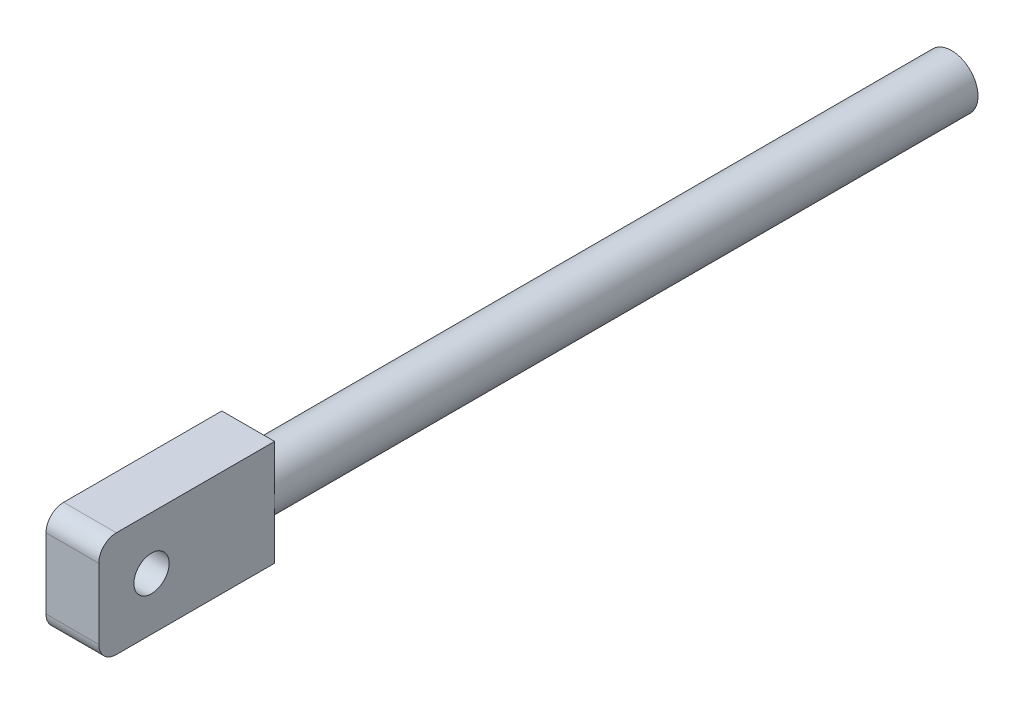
from build123d import *

# Parameters (mm, degrees)
SKETCH2_R           = 15
BOSS_EXTRUDE1_DEPTH = 400
SKETCH3_W           = 30
SKETCH3_H           = 60
BOSS_EXTRUDE2_DEPTH = 100
FILLET1_R           = 10
SKETCH4_R           = 10
CUT_EXTRUDE1_DEPTH  = 100


with BuildPart() as part:
    # Sketch2 → Boss-Extrude1 (new body)
    with BuildSketch(Plane.XY):
        Circle(SKETCH2_R)
    extrude(amount=BOSS_EXTRUDE1_DEPTH)

    # Sketch3 → Boss-Extrude2 (add)
    with BuildSketch(Plane.XY.offset(400)):
        Rectangle(SKETCH3_W, SKETCH3_H)
    extrude(amount=BOSS_EXTRUDE2_DEPTH)

    # Fillet1
    fillet1_edges = [part.edges().sort_by_distance(p)[0] for p in [
        (0, -30, 500),
        (0, 30, 500),
    ]]
    fillet(fillet1_edges, radius=FILLET1_R)

    # Sketch4 → Cut-Extrude1 (cut)
    with BuildSketch(Plane(origin=(15, 0, 0), x_dir=(0, 0, -1), z_dir=(1, 0, 0))):
        with Locations(Location((-470, 0, 0), (0, 0, 90))):
            Circle(SKETCH4_R)
    extrude(amount=-CUT_EXTRUDE1_DEPTH, mode=Mode.SUBTRACT)


solid = part.part
